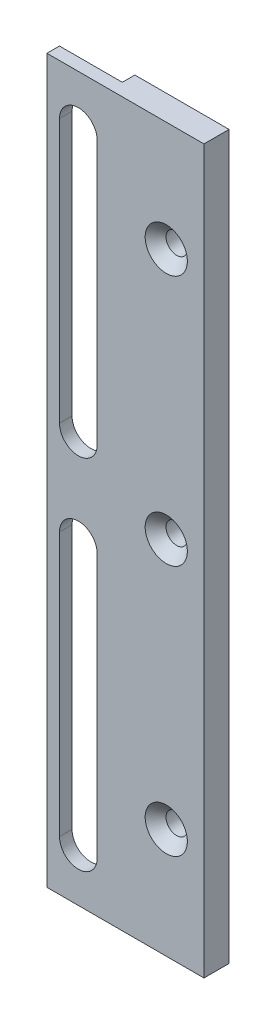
from build123d import *

# Parameters (mm, degrees)
SKETCH1_W                     = 4
SKETCH1_H                     = 115
BOSS_EXTRUDE1_DEPTH           = 25
CUT_EXTRUDE3_DEPTH            = 118.753980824
SKETCH7_W                     = 10
SKETCH7_H                     = 115
CUT_EXTRUDE4_DEPTH            = 2
CSK_FOR_M3_SFHCS1_D           = 3.4
CSK_FOR_M3_SFHCS1_CSINK_D     = 6.72
CSK_FOR_M3_SFHCS1_CSINK_ANGLE = 90


with BuildPart() as part:
    # Sketch1 → Boss-Extrude1 (new body)
    with BuildSketch(Plane(origin=(0, 0, 0), x_dir=(0, 0, -1), z_dir=(1, 0, 0))):
        with Locations((2, 57.5)):
            Rectangle(SKETCH1_W, SKETCH1_H)
    extrude(amount=BOSS_EXTRUDE1_DEPTH)

    # Sketch6 → Cut-Extrude3 (cut, through all)
    with BuildSketch(Plane(origin=(0, 0, -4), x_dir=(-1, 0, 0), z_dir=(0, 0, -1))):
        with BuildLine():
            Line((-2, 107), (-2, 65))
            ThreePointArc((-2, 65), (-5, 62), (-8, 65))
            Line((-8, 65), (-8, 107))
            ThreePointArc((-8, 107), (-5, 110), (-2, 107))
        make_face()
        with BuildLine():
            Line((-2, 50), (-2, 8))
            ThreePointArc((-2, 8), (-5, 5), (-8, 8))
            Line((-8, 8), (-8, 50))
            ThreePointArc((-8, 50), (-5, 53), (-2, 50))
        make_face()
    extrude(amount=-CUT_EXTRUDE3_DEPTH, mode=Mode.SUBTRACT)

    # Sketch7 → Cut-Extrude4 (cut)
    with BuildSketch(Plane(origin=(0, 0, -4), x_dir=(-1, 0, 0), z_dir=(0, 0, -1))):
        with Locations((-5, 57.5)):
            Rectangle(SKETCH7_W, SKETCH7_H)
    extrude(amount=-CUT_EXTRUDE4_DEPTH, mode=Mode.SUBTRACT)

    # CSK for M3 SFHCS1 (through all)
    with Locations(Plane.XY):
        with Locations((19, 97.5), (19, 57.5), (19, 17.5)):
            CounterSinkHole(CSK_FOR_M3_SFHCS1_D / 2, CSK_FOR_M3_SFHCS1_CSINK_D / 2, counter_sink_angle=CSK_FOR_M3_SFHCS1_CSINK_ANGLE)


solid = part.part
